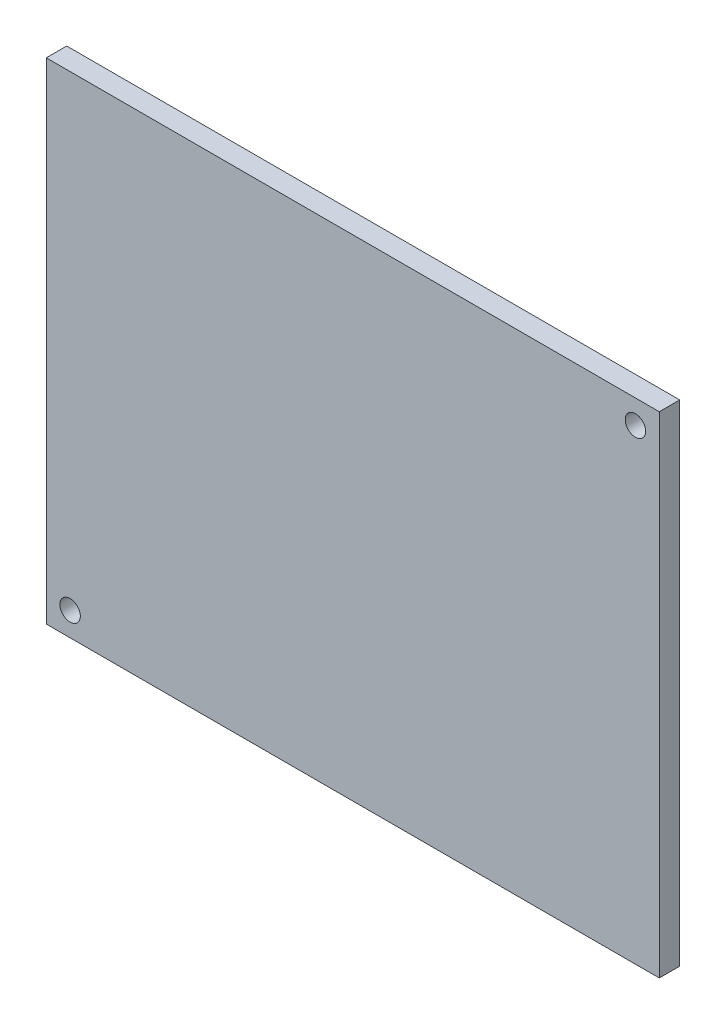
ISO-10303-21;
HEADER;
FILE_DESCRIPTION(('STEP AP214'),'2;1');
FILE_NAME('part.step','',(''),(''),'','','');
FILE_SCHEMA(('AUTOMOTIVE_DESIGN { 1 0 10303 214 1 1 1 1 }'));
ENDSEC;
DATA;
#1=APPLICATION_CONTEXT('core data for automotive mechanical design processes');
#2=APPLICATION_PROTOCOL_DEFINITION('international standard','automotive_design',2000,#1);
#3=PRODUCT_CONTEXT('',#1,'mechanical');
#4=PRODUCT('Part','Part','',(#3));
#5=PRODUCT_RELATED_PRODUCT_CATEGORY('part','',(#4));
#6=PRODUCT_DEFINITION_FORMATION('','',#4);
#7=PRODUCT_DEFINITION_CONTEXT('part definition',#1,'design');
#8=PRODUCT_DEFINITION('design','',#6,#7);
#9=PRODUCT_DEFINITION_SHAPE('','',#8);
#10=(LENGTH_UNIT() NAMED_UNIT(*) SI_UNIT(.MILLI.,.METRE.));
#11=(NAMED_UNIT(*) PLANE_ANGLE_UNIT() SI_UNIT($,.RADIAN.));
#12=(NAMED_UNIT(*) SI_UNIT($,.STERADIAN.) SOLID_ANGLE_UNIT());
#13=UNCERTAINTY_MEASURE_WITH_UNIT(LENGTH_MEASURE(1.E-05),#10,'distance_accuracy_value','');
#14=(GEOMETRIC_REPRESENTATION_CONTEXT(3) GLOBAL_UNCERTAINTY_ASSIGNED_CONTEXT((#13)) GLOBAL_UNIT_ASSIGNED_CONTEXT((#10,
#11,#12)) REPRESENTATION_CONTEXT('',''));
#15=CARTESIAN_POINT('',(0.,0.,0.));
#16=DIRECTION('',(0.,0.,1.));
#17=DIRECTION('',(1.,0.,0.));
#18=AXIS2_PLACEMENT_3D('',#15,#16,#17);
#19=CARTESIAN_POINT('',(0.,-36.,-3.));
#20=DIRECTION('',(0.,-1.,0.));
#21=DIRECTION('',(0.,0.,-1.));
#22=AXIS2_PLACEMENT_3D('',#19,#20,#21);
#23=PLANE('',#22);
#24=DIRECTION('',(1.,0.,0.));
#25=VECTOR('',#24,1.);
#26=CARTESIAN_POINT('',(0.,-36.,0.));
#27=LINE('',#26,#25);
#28=CARTESIAN_POINT('',(-45.,-36.,0.));
#29=VERTEX_POINT('',#28);
#30=CARTESIAN_POINT('',(44.9999999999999,-36.,0.));
#31=VERTEX_POINT('',#30);
#32=EDGE_CURVE('E112',#29,#31,#27,.T.);
#33=ORIENTED_EDGE('',*,*,#32,.F.);
#34=DIRECTION('',(0.,0.,1.));
#35=VECTOR('',#34,1.);
#36=CARTESIAN_POINT('',(-45.,-36.,-3.));
#37=LINE('',#36,#35);
#38=CARTESIAN_POINT('',(-45.,-36.,-3.));
#39=VERTEX_POINT('',#38);
#40=EDGE_CURVE('E12',#39,#29,#37,.T.);
#41=ORIENTED_EDGE('',*,*,#40,.F.);
#42=DIRECTION('',(1.,0.,0.));
#43=VECTOR('',#42,1.);
#44=CARTESIAN_POINT('',(0.,-36.,-3.));
#45=LINE('',#44,#43);
#46=CARTESIAN_POINT('',(44.9999999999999,-36.,-3.));
#47=VERTEX_POINT('',#46);
#48=EDGE_CURVE('E106',#39,#47,#45,.T.);
#49=ORIENTED_EDGE('',*,*,#48,.T.);
#50=DIRECTION('',(0.,0.,1.));
#51=VECTOR('',#50,1.);
#52=CARTESIAN_POINT('',(44.9999999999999,-36.,-3.));
#53=LINE('',#52,#51);
#54=EDGE_CURVE('E49',#47,#31,#53,.T.);
#55=ORIENTED_EDGE('',*,*,#54,.T.);
#56=EDGE_LOOP('',(#33,#41,#49,#55));
#57=FACE_BOUND('',#56,.T.);
#58=ADVANCED_FACE('F46',(#57),#23,.T.);
#59=CARTESIAN_POINT('',(-45.,0.,-3.));
#60=DIRECTION('',(1.,0.,0.));
#61=DIRECTION('',(0.,0.,-1.));
#62=AXIS2_PLACEMENT_3D('',#59,#60,#61);
#63=PLANE('',#62);
#64=DIRECTION('',(0.,1.,0.));
#65=VECTOR('',#64,1.);
#66=CARTESIAN_POINT('',(-45.,0.,0.));
#67=LINE('',#66,#65);
#68=CARTESIAN_POINT('',(-45.,36.,0.));
#69=VERTEX_POINT('',#68);
#70=EDGE_CURVE('E79',#29,#69,#67,.T.);
#71=ORIENTED_EDGE('',*,*,#70,.T.);
#72=DIRECTION('',(0.,0.,1.));
#73=VECTOR('',#72,1.);
#74=CARTESIAN_POINT('',(-45.,36.,-3.));
#75=LINE('',#74,#73);
#76=CARTESIAN_POINT('',(-45.,36.,-3.));
#77=VERTEX_POINT('',#76);
#78=EDGE_CURVE('E55',#77,#69,#75,.T.);
#79=ORIENTED_EDGE('',*,*,#78,.F.);
#80=DIRECTION('',(0.,1.,0.));
#81=VECTOR('',#80,1.);
#82=CARTESIAN_POINT('',(-45.,0.,-3.));
#83=LINE('',#82,#81);
#84=EDGE_CURVE('E96',#39,#77,#83,.T.);
#85=ORIENTED_EDGE('',*,*,#84,.F.);
#86=ORIENTED_EDGE('',*,*,#40,.T.);
#87=EDGE_LOOP('',(#71,#79,#85,#86));
#88=FACE_BOUND('',#87,.T.);
#89=ADVANCED_FACE('F123',(#88),#63,.F.);
#90=CARTESIAN_POINT('',(0.,36.,-3.));
#91=DIRECTION('',(0.,-1.,0.));
#92=DIRECTION('',(0.,0.,-1.));
#93=AXIS2_PLACEMENT_3D('',#90,#91,#92);
#94=PLANE('',#93);
#95=DIRECTION('',(1.,0.,0.));
#96=VECTOR('',#95,1.);
#97=CARTESIAN_POINT('',(0.,36.,0.));
#98=LINE('',#97,#96);
#99=CARTESIAN_POINT('',(44.9999999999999,36.,0.));
#100=VERTEX_POINT('',#99);
#101=EDGE_CURVE('E103',#69,#100,#98,.T.);
#102=ORIENTED_EDGE('',*,*,#101,.T.);
#103=DIRECTION('',(0.,0.,1.));
#104=VECTOR('',#103,1.);
#105=CARTESIAN_POINT('',(44.9999999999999,36.,-3.));
#106=LINE('',#105,#104);
#107=CARTESIAN_POINT('',(44.9999999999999,36.,-3.));
#108=VERTEX_POINT('',#107);
#109=EDGE_CURVE('E100',#108,#100,#106,.T.);
#110=ORIENTED_EDGE('',*,*,#109,.F.);
#111=DIRECTION('',(1.,0.,0.));
#112=VECTOR('',#111,1.);
#113=CARTESIAN_POINT('',(0.,36.,-3.));
#114=LINE('',#113,#112);
#115=EDGE_CURVE('E91',#77,#108,#114,.T.);
#116=ORIENTED_EDGE('',*,*,#115,.F.);
#117=ORIENTED_EDGE('',*,*,#78,.T.);
#118=EDGE_LOOP('',(#102,#110,#116,#117));
#119=FACE_BOUND('',#118,.T.);
#120=ADVANCED_FACE('F101',(#119),#94,.F.);
#121=CARTESIAN_POINT('',(44.9999999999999,0.,-3.));
#122=DIRECTION('',(1.,0.,0.));
#123=DIRECTION('',(0.,0.,-1.));
#124=AXIS2_PLACEMENT_3D('',#121,#122,#123);
#125=PLANE('',#124);
#126=DIRECTION('',(0.,1.,0.));
#127=VECTOR('',#126,1.);
#128=CARTESIAN_POINT('',(44.9999999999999,0.,0.));
#129=LINE('',#128,#127);
#130=EDGE_CURVE('E115',#31,#100,#129,.T.);
#131=ORIENTED_EDGE('',*,*,#130,.F.);
#132=ORIENTED_EDGE('',*,*,#54,.F.);
#133=DIRECTION('',(0.,1.,0.));
#134=VECTOR('',#133,1.);
#135=CARTESIAN_POINT('',(44.9999999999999,0.,-3.));
#136=LINE('',#135,#134);
#137=EDGE_CURVE('E95',#47,#108,#136,.T.);
#138=ORIENTED_EDGE('',*,*,#137,.T.);
#139=ORIENTED_EDGE('',*,*,#109,.T.);
#140=EDGE_LOOP('',(#131,#132,#138,#139));
#141=FACE_BOUND('',#140,.T.);
#142=ADVANCED_FACE('F105',(#141),#125,.T.);
#143=CARTESIAN_POINT('',(0.,0.,-3.));
#144=DIRECTION('',(0.,0.,1.));
#145=DIRECTION('',(1.,0.,0.));
#146=AXIS2_PLACEMENT_3D('',#143,#144,#145);
#147=PLANE('',#146);
#148=CARTESIAN_POINT('',(41.4999999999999,32.5000000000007,-3.));
#149=DIRECTION('',(0.,0.,1.));
#150=DIRECTION('',(1.,0.,0.));
#151=AXIS2_PLACEMENT_3D('',#148,#149,#150);
#152=CIRCLE('',#151,1.49999999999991);
#153=CARTESIAN_POINT('',(42.9999999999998,32.5000000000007,-3.));
#154=VERTEX_POINT('',#153);
#155=EDGE_CURVE('E157',#154,#154,#152,.T.);
#156=ORIENTED_EDGE('',*,*,#155,.T.);
#157=EDGE_LOOP('',(#156));
#158=FACE_BOUND('',#157,.T.);
#159=CARTESIAN_POINT('',(-41.5000000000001,-32.4999999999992,-3.));
#160=DIRECTION('',(0.,0.,1.));
#161=DIRECTION('',(1.,0.,0.));
#162=AXIS2_PLACEMENT_3D('',#159,#160,#161);
#163=CIRCLE('',#162,1.49999999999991);
#164=CARTESIAN_POINT('',(-40.0000000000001,-32.4999999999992,-3.));
#165=VERTEX_POINT('',#164);
#166=EDGE_CURVE('E116',#165,#165,#163,.T.);
#167=ORIENTED_EDGE('',*,*,#166,.T.);
#168=EDGE_LOOP('',(#167));
#169=FACE_BOUND('',#168,.T.);
#170=ORIENTED_EDGE('',*,*,#48,.F.);
#171=ORIENTED_EDGE('',*,*,#84,.T.);
#172=ORIENTED_EDGE('',*,*,#115,.T.);
#173=ORIENTED_EDGE('',*,*,#137,.F.);
#174=EDGE_LOOP('',(#170,#171,#172,#173));
#175=FACE_BOUND('',#174,.T.);
#176=ADVANCED_FACE('F94',(#158,#169,#175),#147,.F.);
#177=CARTESIAN_POINT('',(0.,0.,0.));
#178=DIRECTION('',(0.,0.,1.));
#179=DIRECTION('',(1.,0.,0.));
#180=AXIS2_PLACEMENT_3D('',#177,#178,#179);
#181=PLANE('',#180);
#182=CARTESIAN_POINT('',(41.4999999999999,32.5000000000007,0.));
#183=DIRECTION('',(0.,0.,1.));
#184=DIRECTION('',(1.,0.,0.));
#185=AXIS2_PLACEMENT_3D('',#182,#183,#184);
#186=CIRCLE('',#185,1.49999999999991);
#187=CARTESIAN_POINT('',(42.9999999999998,32.5000000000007,0.));
#188=VERTEX_POINT('',#187);
#189=EDGE_CURVE('E160',#188,#188,#186,.T.);
#190=ORIENTED_EDGE('',*,*,#189,.F.);
#191=EDGE_LOOP('',(#190));
#192=FACE_BOUND('',#191,.T.);
#193=CARTESIAN_POINT('',(-41.5000000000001,-32.4999999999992,0.));
#194=DIRECTION('',(0.,0.,1.));
#195=DIRECTION('',(1.,0.,0.));
#196=AXIS2_PLACEMENT_3D('',#193,#194,#195);
#197=CIRCLE('',#196,1.49999999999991);
#198=CARTESIAN_POINT('',(-40.0000000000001,-32.4999999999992,0.));
#199=VERTEX_POINT('',#198);
#200=EDGE_CURVE('E161',#199,#199,#197,.T.);
#201=ORIENTED_EDGE('',*,*,#200,.F.);
#202=EDGE_LOOP('',(#201));
#203=FACE_BOUND('',#202,.T.);
#204=ORIENTED_EDGE('',*,*,#32,.T.);
#205=ORIENTED_EDGE('',*,*,#130,.T.);
#206=ORIENTED_EDGE('',*,*,#101,.F.);
#207=ORIENTED_EDGE('',*,*,#70,.F.);
#208=EDGE_LOOP('',(#204,#205,#206,#207));
#209=FACE_BOUND('',#208,.T.);
#210=ADVANCED_FACE('F121',(#192,#203,#209),#181,.T.);
#211=CARTESIAN_POINT('',(-41.5000000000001,-32.4999999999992,-3.));
#212=DIRECTION('',(0.,0.,1.));
#213=DIRECTION('',(1.,0.,0.));
#214=AXIS2_PLACEMENT_3D('',#211,#212,#213);
#215=CYLINDRICAL_SURFACE('',#214,1.49999999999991);
#216=ORIENTED_EDGE('',*,*,#166,.F.);
#217=EDGE_LOOP('',(#216));
#218=FACE_BOUND('',#217,.T.);
#219=ORIENTED_EDGE('',*,*,#200,.T.);
#220=EDGE_LOOP('',(#219));
#221=FACE_BOUND('',#220,.T.);
#222=ADVANCED_FACE('F142',(#218,#221),#215,.F.);
#223=CARTESIAN_POINT('',(41.4999999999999,32.5000000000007,-3.));
#224=DIRECTION('',(0.,0.,1.));
#225=DIRECTION('',(1.,0.,0.));
#226=AXIS2_PLACEMENT_3D('',#223,#224,#225);
#227=CYLINDRICAL_SURFACE('',#226,1.49999999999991);
#228=ORIENTED_EDGE('',*,*,#155,.F.);
#229=EDGE_LOOP('',(#228));
#230=FACE_BOUND('',#229,.T.);
#231=ORIENTED_EDGE('',*,*,#189,.T.);
#232=EDGE_LOOP('',(#231));
#233=FACE_BOUND('',#232,.T.);
#234=ADVANCED_FACE('F149',(#230,#233),#227,.F.);
#235=CLOSED_SHELL('',(#58,#89,#120,#142,#176,#210,#222,#234));
#236=MANIFOLD_SOLID_BREP('B2',#235);
#237=ADVANCED_BREP_SHAPE_REPRESENTATION('',(#18,#236),#14);
#238=SHAPE_DEFINITION_REPRESENTATION(#9,#237);
ENDSEC;
END-ISO-10303-21;
